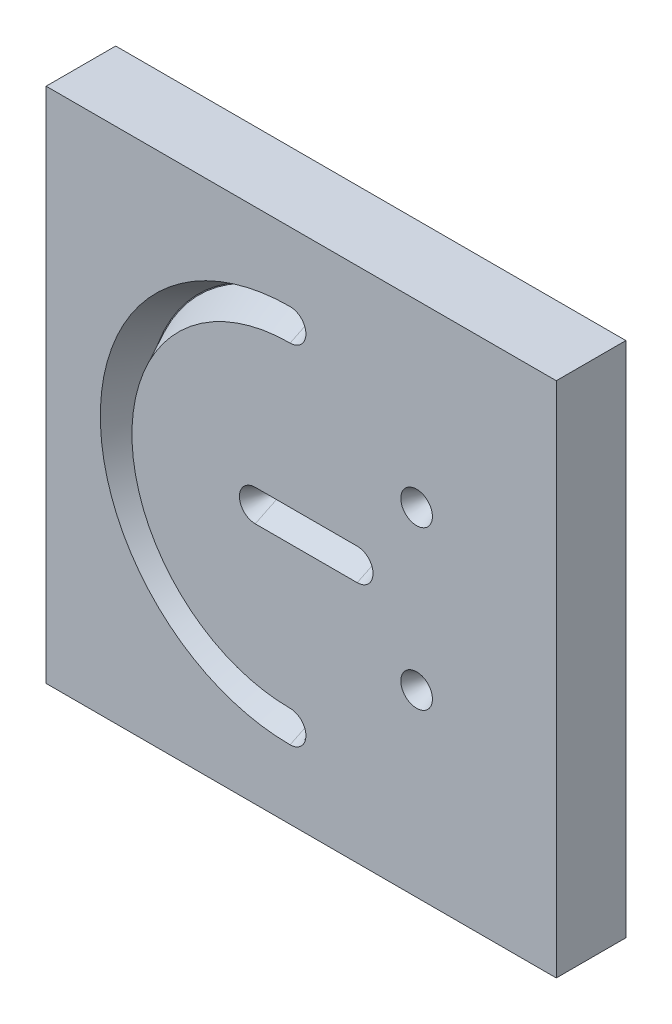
from build123d import *

# Parameters (mm, degrees)
SKIZZE1_W                                 = 80.645827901
SKIZZE1_H                                 = 81.771773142
LINEAR_AUSTRAGEN1_DEPTH                   = 11
SKIZZE2_R                                 = 2.5
SCHNITT_LINEAR_AUSTRAGEN2_DEPTH           = 5
SCHNITT_LINEAR_AUSTRAGEN2_DRAFT           = -26
SCHNITT_LINEAR_AUSTRAGEN2_PROFILE_2_DEPTH = 5
SCHNITT_LINEAR_AUSTRAGEN2_PROFILE_2_DRAFT = -26
SCHNITT_LINEAR_AUSTRAGEN2_PROFILE_3_DEPTH = 5
SCHNITT_LINEAR_AUSTRAGEN2_PROFILE_3_DRAFT = -26
SCHNITT_LINEAR_AUSTRAGEN2_PROFILE_4_DEPTH = 5
SCHNITT_LINEAR_AUSTRAGEN2_PROFILE_4_DRAFT = -26


with BuildPart() as part:
    # Skizze1 → Linear austragen1 (new body)
    with BuildSketch(Plane.XY):
        with Locations((40.322913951, 40.885886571)):
            Rectangle(SKIZZE1_W, SKIZZE1_H)
    extrude(amount=LINEAR_AUSTRAGEN1_DEPTH)


with BuildPart() as schnitt_linear_austragen2_tool:
    # Skizze2 → Schnitt-Linear austragen2 (with draft: the straight prism first)
    with BuildSketch(Plane.XY.offset(11)):
        with Locations((58.567090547, 53.385886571)):
            Circle(SKIZZE2_R)
    extrude(amount=-SCHNITT_LINEAR_AUSTRAGEN2_DEPTH)
    # Schnitt-Linear austragen2: the draft: its side faces are tilted about the plane it starts from
    schnitt_linear_austragen2_sides = [schnitt_linear_austragen2_tool.faces().sort_by_distance(p)[0] for p in [
        (56.067090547, 53.385886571, 8.5),
    ]]
    draft(schnitt_linear_austragen2_sides, Plane.XY.offset(11), SCHNITT_LINEAR_AUSTRAGEN2_DRAFT)


with BuildPart() as part_1:
    add(part.part)

    # Schnitt-Linear austragen2: cut by schnitt_linear_austragen2_tool
    add(schnitt_linear_austragen2_tool.part, mode=Mode.SUBTRACT)


with BuildPart() as schnitt_linear_austragen2_profile_2_tool:
    # Skizze2 → Schnitt-Linear austragen2 profile 2 (with draft: the straight prism first)
    with BuildSketch(Plane.XY.offset(11)):
        with Locations((58.567090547, 28.385886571)):
            Circle(SKIZZE2_R)
    extrude(amount=-SCHNITT_LINEAR_AUSTRAGEN2_PROFILE_2_DEPTH)
    # Schnitt-Linear austragen2 profile 2: the draft: its side faces are tilted about the plane it starts from
    schnitt_linear_austragen2_profile_2_sides = [schnitt_linear_austragen2_profile_2_tool.faces().sort_by_distance(p)[0] for p in [
        (56.067090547, 28.385886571, 8.5),
    ]]
    draft(schnitt_linear_austragen2_profile_2_sides, Plane.XY.offset(11), SCHNITT_LINEAR_AUSTRAGEN2_PROFILE_2_DRAFT)


with BuildPart() as part_2:
    add(part_1.part)

    # Schnitt-Linear austragen2 profile 2: cut by schnitt_linear_austragen2_profile_2_tool
    add(schnitt_linear_austragen2_profile_2_tool.part, mode=Mode.SUBTRACT)


with BuildPart() as schnitt_linear_austragen2_profile_3_tool:
    # Skizze2 → Schnitt-Linear austragen2 profile 3 (with draft: the straight prism first)
    with BuildSketch(Plane.XY.offset(11)):
        with BuildLine():
            Line((49.178322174, 43.385886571), (33.0551925, 43.385886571))
            ThreePointArc((33.0551925, 43.385886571), (30.5551925, 40.885886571), (33.0551925, 38.385886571))
            Line((33.0551925, 38.385886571), (49.178322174, 38.385886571))
            ThreePointArc((49.178322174, 38.385886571), (51.678322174, 40.885886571), (49.178322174, 43.385886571))
        make_face()
    extrude(amount=-SCHNITT_LINEAR_AUSTRAGEN2_PROFILE_3_DEPTH)
    # Schnitt-Linear austragen2 profile 3: the draft: its side faces are tilted about the plane it starts from
    schnitt_linear_austragen2_profile_3_sides = [schnitt_linear_austragen2_profile_3_tool.faces().sort_by_distance(p)[0] for p in [
        (41.116757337, 43.385886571, 8.5),
        (30.5551925, 40.885886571, 8.5),
        (41.116757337, 38.385886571, 8.5),
        (51.678322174, 40.885886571, 8.5),
    ]]
    draft(schnitt_linear_austragen2_profile_3_sides, Plane.XY.offset(11), SCHNITT_LINEAR_AUSTRAGEN2_PROFILE_3_DRAFT)


with BuildPart() as part_3:
    add(part_2.part)

    # Schnitt-Linear austragen2 profile 3: cut by schnitt_linear_austragen2_profile_3_tool
    add(schnitt_linear_austragen2_profile_3_tool.part, mode=Mode.SUBTRACT)


with BuildPart() as schnitt_linear_austragen2_profile_4_tool:
    # Skizze2 → Schnitt-Linear austragen2 profile 4 (with draft: the straight prism first)
    with BuildSketch(Plane.XY.offset(11)):
        with BuildLine():
            ThreePointArc((38.567090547, 65.885886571), (41.067090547, 68.385886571), (38.567090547, 70.885886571))
            ThreePointArc((38.567090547, 70.885886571), (8.567090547, 40.885886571), (38.567090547, 10.885886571))
            ThreePointArc((38.567090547, 10.885886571), (41.067090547, 13.385886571), (38.567090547, 15.885886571))
            ThreePointArc((38.567090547, 15.885886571), (13.567090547, 40.885886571), (38.567090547, 65.885886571))
        make_face()
    extrude(amount=-SCHNITT_LINEAR_AUSTRAGEN2_PROFILE_4_DEPTH)
    # Schnitt-Linear austragen2 profile 4: the draft: its side faces are tilted about the plane it starts from
    schnitt_linear_austragen2_profile_4_sides = [schnitt_linear_austragen2_profile_4_tool.faces().sort_by_distance(p)[0] for p in [
        (41.067090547, 68.385886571, 8.5),
        (8.567090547, 40.885886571, 8.5),
        (41.067090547, 13.385886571, 8.5),
        (13.567090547, 40.885886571, 8.5),
    ]]
    draft(schnitt_linear_austragen2_profile_4_sides, Plane.XY.offset(11), SCHNITT_LINEAR_AUSTRAGEN2_PROFILE_4_DRAFT)


with BuildPart() as part_4:
    add(part_3.part)

    # Schnitt-Linear austragen2 profile 4: cut by schnitt_linear_austragen2_profile_4_tool
    add(schnitt_linear_austragen2_profile_4_tool.part, mode=Mode.SUBTRACT)


solid = part_4.part
